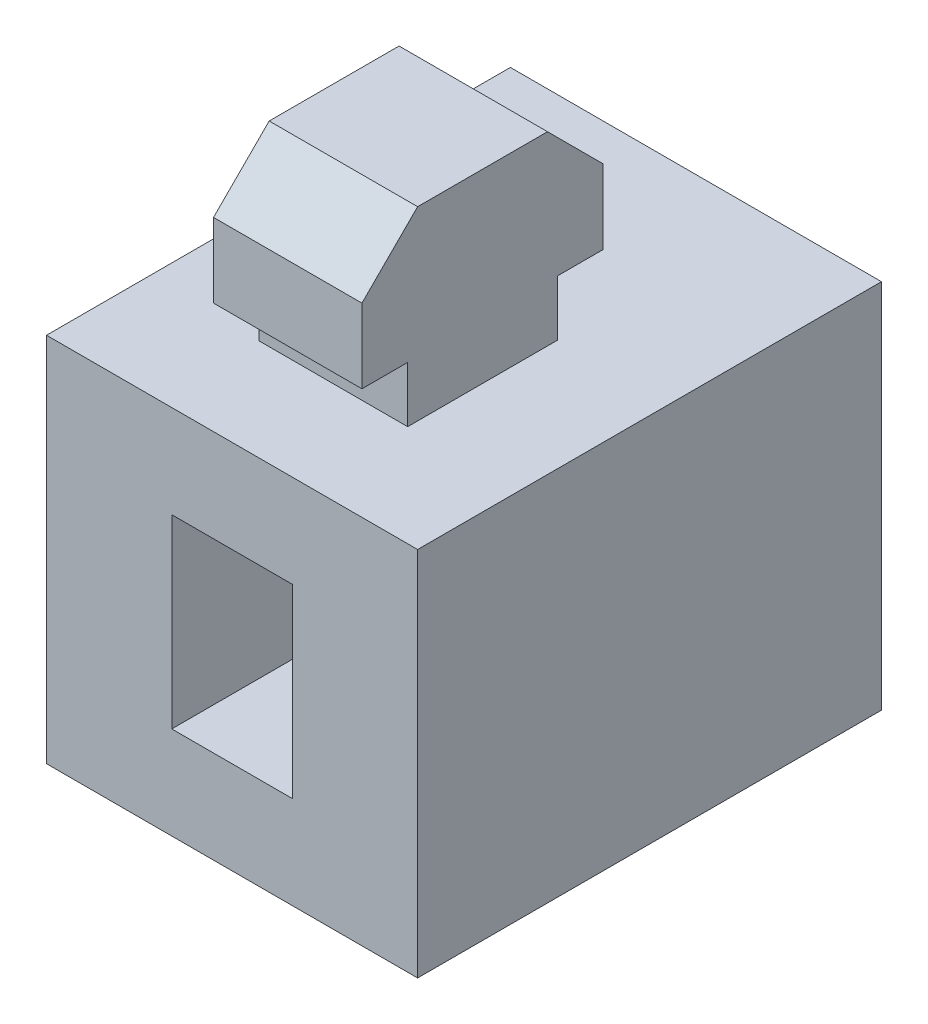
ISO-10303-21;
HEADER;
FILE_DESCRIPTION(('STEP AP214'),'2;1');
FILE_NAME('part.step','',(''),(''),'','','');
FILE_SCHEMA(('AUTOMOTIVE_DESIGN { 1 0 10303 214 1 1 1 1 }'));
ENDSEC;
DATA;
#1=APPLICATION_CONTEXT('core data for automotive mechanical design processes');
#2=APPLICATION_PROTOCOL_DEFINITION('international standard','automotive_design',2000,#1);
#3=PRODUCT_CONTEXT('',#1,'mechanical');
#4=PRODUCT('Part','Part','',(#3));
#5=PRODUCT_RELATED_PRODUCT_CATEGORY('part','',(#4));
#6=PRODUCT_DEFINITION_FORMATION('','',#4);
#7=PRODUCT_DEFINITION_CONTEXT('part definition',#1,'design');
#8=PRODUCT_DEFINITION('design','',#6,#7);
#9=PRODUCT_DEFINITION_SHAPE('','',#8);
#10=(LENGTH_UNIT() NAMED_UNIT(*) SI_UNIT(.MILLI.,.METRE.));
#11=(NAMED_UNIT(*) PLANE_ANGLE_UNIT() SI_UNIT($,.RADIAN.));
#12=(NAMED_UNIT(*) SI_UNIT($,.STERADIAN.) SOLID_ANGLE_UNIT());
#13=UNCERTAINTY_MEASURE_WITH_UNIT(LENGTH_MEASURE(1.E-05),#10,'distance_accuracy_value','');
#14=(GEOMETRIC_REPRESENTATION_CONTEXT(3) GLOBAL_UNCERTAINTY_ASSIGNED_CONTEXT((#13)) GLOBAL_UNIT_ASSIGNED_CONTEXT((#10,
#11,#12)) REPRESENTATION_CONTEXT('',''));
#15=CARTESIAN_POINT('',(0.,0.,0.));
#16=DIRECTION('',(0.,0.,1.));
#17=DIRECTION('',(1.,0.,0.));
#18=AXIS2_PLACEMENT_3D('',#15,#16,#17);
#19=CARTESIAN_POINT('',(-4.,20.,-3.5));
#20=DIRECTION('',(1.,0.,0.));
#21=DIRECTION('',(0.,1.,0.));
#22=AXIS2_PLACEMENT_3D('',#19,#20,#21);
#23=PLANE('',#22);
#24=DIRECTION('',(0.,-0.707106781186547,0.707106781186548));
#25=VECTOR('',#24,1.);
#26=CARTESIAN_POINT('',(-4.,25.,1.5));
#27=LINE('',#26,#25);
#28=CARTESIAN_POINT('',(-4.,20.,6.5));
#29=VERTEX_POINT('',#28);
#30=CARTESIAN_POINT('',(-4.,17.,9.5));
#31=VERTEX_POINT('',#30);
#32=EDGE_CURVE('E208',#29,#31,#27,.T.);
#33=ORIENTED_EDGE('',*,*,#32,.F.);
#34=DIRECTION('',(0.,0.,1.));
#35=VECTOR('',#34,1.);
#36=CARTESIAN_POINT('',(-4.,20.,-3.5));
#37=LINE('',#36,#35);
#38=CARTESIAN_POINT('',(-4.,20.,-0.5));
#39=VERTEX_POINT('',#38);
#40=EDGE_CURVE('E397',#39,#29,#37,.T.);
#41=ORIENTED_EDGE('',*,*,#40,.F.);
#42=DIRECTION('',(0.,-0.707106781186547,-0.707106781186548));
#43=VECTOR('',#42,1.);
#44=CARTESIAN_POINT('',(-4.,18.5,-2.));
#45=LINE('',#44,#43);
#46=CARTESIAN_POINT('',(-4.,17.,-3.5));
#47=VERTEX_POINT('',#46);
#48=EDGE_CURVE('E56',#39,#47,#45,.T.);
#49=ORIENTED_EDGE('',*,*,#48,.T.);
#50=DIRECTION('',(0.,-1.,0.));
#51=VECTOR('',#50,1.);
#52=CARTESIAN_POINT('',(-4.,20.,-3.5));
#53=LINE('',#52,#51);
#54=CARTESIAN_POINT('',(-4.,13.,-3.5));
#55=VERTEX_POINT('',#54);
#56=EDGE_CURVE('E231',#47,#55,#53,.T.);
#57=ORIENTED_EDGE('',*,*,#56,.T.);
#58=DIRECTION('',(0.,0.,1.));
#59=VECTOR('',#58,1.);
#60=CARTESIAN_POINT('',(-4.,13.,-3.5));
#61=LINE('',#60,#59);
#62=CARTESIAN_POINT('',(-4.,13.,-1.03588894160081));
#63=VERTEX_POINT('',#62);
#64=EDGE_CURVE('E389',#55,#63,#61,.T.);
#65=ORIENTED_EDGE('',*,*,#64,.T.);
#66=DIRECTION('',(0.,-1.,0.));
#67=VECTOR('',#66,1.);
#68=CARTESIAN_POINT('',(-4.,20.,-1.03588894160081));
#69=LINE('',#68,#67);
#70=CARTESIAN_POINT('',(-4.,10.,-1.03588894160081));
#71=VERTEX_POINT('',#70);
#72=EDGE_CURVE('E393',#63,#71,#69,.T.);
#73=ORIENTED_EDGE('',*,*,#72,.T.);
#74=DIRECTION('',(0.,0.,1.));
#75=VECTOR('',#74,1.);
#76=CARTESIAN_POINT('',(-4.,10.,-3.5));
#77=LINE('',#76,#75);
#78=CARTESIAN_POINT('',(-4.,10.,7.03588894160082));
#79=VERTEX_POINT('',#78);
#80=EDGE_CURVE('E396',#71,#79,#77,.T.);
#81=ORIENTED_EDGE('',*,*,#80,.T.);
#82=DIRECTION('',(0.,-1.,0.));
#83=VECTOR('',#82,1.);
#84=CARTESIAN_POINT('',(-4.,20.,7.03588894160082));
#85=LINE('',#84,#83);
#86=CARTESIAN_POINT('',(-4.,13.,7.03588894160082));
#87=VERTEX_POINT('',#86);
#88=EDGE_CURVE('E373',#87,#79,#85,.T.);
#89=ORIENTED_EDGE('',*,*,#88,.F.);
#90=DIRECTION('',(0.,0.,-1.));
#91=VECTOR('',#90,1.);
#92=CARTESIAN_POINT('',(-4.,13.,-3.5));
#93=LINE('',#92,#91);
#94=CARTESIAN_POINT('',(-4.,13.,9.5));
#95=VERTEX_POINT('',#94);
#96=EDGE_CURVE('E377',#95,#87,#93,.T.);
#97=ORIENTED_EDGE('',*,*,#96,.F.);
#98=DIRECTION('',(0.,-1.,0.));
#99=VECTOR('',#98,1.);
#100=CARTESIAN_POINT('',(-4.,20.,9.5));
#101=LINE('',#100,#99);
#102=EDGE_CURVE('E226',#31,#95,#101,.T.);
#103=ORIENTED_EDGE('',*,*,#102,.F.);
#104=EDGE_LOOP('',(#33,#41,#49,#57,#65,#73,#81,#89,#97,#103));
#105=FACE_BOUND('',#104,.T.);
#106=ADVANCED_FACE('F34',(#105),#23,.F.);
#107=CARTESIAN_POINT('',(-4.,20.,9.5));
#108=DIRECTION('',(0.,0.,-1.));
#109=DIRECTION('',(-1.,0.,0.));
#110=AXIS2_PLACEMENT_3D('',#107,#108,#109);
#111=PLANE('',#110);
#112=DIRECTION('',(1.,0.,0.));
#113=VECTOR('',#112,1.);
#114=CARTESIAN_POINT('',(-10.,17.,9.5));
#115=LINE('',#114,#113);
#116=CARTESIAN_POINT('',(4.,17.,9.5));
#117=VERTEX_POINT('',#116);
#118=EDGE_CURVE('E205',#31,#117,#115,.T.);
#119=ORIENTED_EDGE('',*,*,#118,.F.);
#120=ORIENTED_EDGE('',*,*,#102,.T.);
#121=DIRECTION('',(-1.,0.,0.));
#122=VECTOR('',#121,1.);
#123=CARTESIAN_POINT('',(-4.,13.,9.5));
#124=LINE('',#123,#122);
#125=CARTESIAN_POINT('',(4.,13.,9.5));
#126=VERTEX_POINT('',#125);
#127=EDGE_CURVE('E225',#126,#95,#124,.T.);
#128=ORIENTED_EDGE('',*,*,#127,.F.);
#129=DIRECTION('',(0.,-1.,0.));
#130=VECTOR('',#129,1.);
#131=CARTESIAN_POINT('',(4.00000000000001,20.,9.5));
#132=LINE('',#131,#130);
#133=EDGE_CURVE('E217',#117,#126,#132,.T.);
#134=ORIENTED_EDGE('',*,*,#133,.F.);
#135=EDGE_LOOP('',(#119,#120,#128,#134));
#136=FACE_BOUND('',#135,.T.);
#137=ADVANCED_FACE('F223',(#136),#111,.F.);
#138=CARTESIAN_POINT('',(4.,20.,-3.5));
#139=DIRECTION('',(-1.,0.,0.));
#140=DIRECTION('',(0.,-1.,0.));
#141=AXIS2_PLACEMENT_3D('',#138,#139,#140);
#142=PLANE('',#141);
#143=DIRECTION('',(0.,-0.707106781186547,0.707106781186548));
#144=VECTOR('',#143,1.);
#145=CARTESIAN_POINT('',(4.,20.,6.5));
#146=LINE('',#145,#144);
#147=CARTESIAN_POINT('',(4.00000000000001,20.,6.5));
#148=VERTEX_POINT('',#147);
#149=EDGE_CURVE('E49',#148,#117,#146,.T.);
#150=ORIENTED_EDGE('',*,*,#149,.T.);
#151=ORIENTED_EDGE('',*,*,#133,.T.);
#152=DIRECTION('',(0.,0.,1.));
#153=VECTOR('',#152,1.);
#154=CARTESIAN_POINT('',(4.,13.,-3.5));
#155=LINE('',#154,#153);
#156=CARTESIAN_POINT('',(4.,13.,7.03588894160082));
#157=VERTEX_POINT('',#156);
#158=EDGE_CURVE('E352',#157,#126,#155,.T.);
#159=ORIENTED_EDGE('',*,*,#158,.F.);
#160=DIRECTION('',(0.,-1.,0.));
#161=VECTOR('',#160,1.);
#162=CARTESIAN_POINT('',(4.,10.,7.03588894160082));
#163=LINE('',#162,#161);
#164=CARTESIAN_POINT('',(4.,10.,7.03588894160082));
#165=VERTEX_POINT('',#164);
#166=EDGE_CURVE('E367',#157,#165,#163,.T.);
#167=ORIENTED_EDGE('',*,*,#166,.T.);
#168=DIRECTION('',(0.,0.,-1.));
#169=VECTOR('',#168,1.);
#170=CARTESIAN_POINT('',(4.,10.,-3.5));
#171=LINE('',#170,#169);
#172=CARTESIAN_POINT('',(4.,10.,-1.03588894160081));
#173=VERTEX_POINT('',#172);
#174=EDGE_CURVE('E399',#165,#173,#171,.T.);
#175=ORIENTED_EDGE('',*,*,#174,.T.);
#176=DIRECTION('',(0.,-1.,0.));
#177=VECTOR('',#176,1.);
#178=CARTESIAN_POINT('',(4.,10.,-1.03588894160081));
#179=LINE('',#178,#177);
#180=CARTESIAN_POINT('',(4.,13.,-1.03588894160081));
#181=VERTEX_POINT('',#180);
#182=EDGE_CURVE('E382',#181,#173,#179,.T.);
#183=ORIENTED_EDGE('',*,*,#182,.F.);
#184=DIRECTION('',(0.,0.,1.));
#185=VECTOR('',#184,1.);
#186=CARTESIAN_POINT('',(4.,13.,-3.53588894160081));
#187=LINE('',#186,#185);
#188=CARTESIAN_POINT('',(4.,13.,-3.5));
#189=VERTEX_POINT('',#188);
#190=EDGE_CURVE('E379',#189,#181,#187,.T.);
#191=ORIENTED_EDGE('',*,*,#190,.F.);
#192=DIRECTION('',(0.,-1.,0.));
#193=VECTOR('',#192,1.);
#194=CARTESIAN_POINT('',(4.,20.,-3.5));
#195=LINE('',#194,#193);
#196=CARTESIAN_POINT('',(4.,17.,-3.5));
#197=VERTEX_POINT('',#196);
#198=EDGE_CURVE('E227',#197,#189,#195,.T.);
#199=ORIENTED_EDGE('',*,*,#198,.F.);
#200=DIRECTION('',(0.,-0.707106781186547,-0.707106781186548));
#201=VECTOR('',#200,1.);
#202=CARTESIAN_POINT('',(4.,20.,-0.499999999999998));
#203=LINE('',#202,#201);
#204=CARTESIAN_POINT('',(4.,20.,-0.499999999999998));
#205=VERTEX_POINT('',#204);
#206=EDGE_CURVE('E354',#205,#197,#203,.T.);
#207=ORIENTED_EDGE('',*,*,#206,.F.);
#208=DIRECTION('',(0.,0.,-1.));
#209=VECTOR('',#208,1.);
#210=CARTESIAN_POINT('',(4.,20.,-3.5));
#211=LINE('',#210,#209);
#212=EDGE_CURVE('E220',#148,#205,#211,.T.);
#213=ORIENTED_EDGE('',*,*,#212,.F.);
#214=EDGE_LOOP('',(#150,#151,#159,#167,#175,#183,#191,#199,#207,#213));
#215=FACE_BOUND('',#214,.T.);
#216=ADVANCED_FACE('F215',(#215),#142,.F.);
#217=CARTESIAN_POINT('',(0.,20.,0.));
#218=DIRECTION('',(0.,1.,0.));
#219=DIRECTION('',(0.,0.,1.));
#220=AXIS2_PLACEMENT_3D('',#217,#218,#219);
#221=PLANE('',#220);
#222=ORIENTED_EDGE('',*,*,#40,.T.);
#223=DIRECTION('',(1.,0.,0.));
#224=VECTOR('',#223,1.);
#225=CARTESIAN_POINT('',(0.,20.,6.5));
#226=LINE('',#225,#224);
#227=EDGE_CURVE('E11',#29,#148,#226,.T.);
#228=ORIENTED_EDGE('',*,*,#227,.T.);
#229=ORIENTED_EDGE('',*,*,#212,.T.);
#230=DIRECTION('',(1.,0.,0.));
#231=VECTOR('',#230,1.);
#232=CARTESIAN_POINT('',(0.,20.,-0.499999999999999));
#233=LINE('',#232,#231);
#234=EDGE_CURVE('E42',#39,#205,#233,.T.);
#235=ORIENTED_EDGE('',*,*,#234,.F.);
#236=EDGE_LOOP('',(#222,#228,#229,#235));
#237=FACE_BOUND('',#236,.T.);
#238=ADVANCED_FACE('F481',(#237),#221,.T.);
#239=CARTESIAN_POINT('',(-10.,10.,12.5));
#240=DIRECTION('',(0.,-1.,0.));
#241=DIRECTION('',(1.,0.,0.));
#242=AXIS2_PLACEMENT_3D('',#239,#240,#241);
#243=PLANE('',#242);
#244=DIRECTION('',(-1.,0.,0.));
#245=VECTOR('',#244,1.);
#246=CARTESIAN_POINT('',(-10.,10.,-12.5));
#247=LINE('',#246,#245);
#248=CARTESIAN_POINT('',(10.,10.,-12.5));
#249=VERTEX_POINT('',#248);
#250=CARTESIAN_POINT('',(-10.,10.,-12.5));
#251=VERTEX_POINT('',#250);
#252=EDGE_CURVE('E320',#249,#251,#247,.T.);
#253=ORIENTED_EDGE('',*,*,#252,.T.);
#254=DIRECTION('',(0.,0.,-1.));
#255=VECTOR('',#254,1.);
#256=CARTESIAN_POINT('',(-10.,10.,12.5));
#257=LINE('',#256,#255);
#258=CARTESIAN_POINT('',(-10.,10.,12.5));
#259=VERTEX_POINT('',#258);
#260=EDGE_CURVE('E326',#259,#251,#257,.T.);
#261=ORIENTED_EDGE('',*,*,#260,.F.);
#262=DIRECTION('',(-1.,0.,0.));
#263=VECTOR('',#262,1.);
#264=CARTESIAN_POINT('',(-10.,10.,12.5));
#265=LINE('',#264,#263);
#266=CARTESIAN_POINT('',(10.,10.,12.5));
#267=VERTEX_POINT('',#266);
#268=EDGE_CURVE('E324',#267,#259,#265,.T.);
#269=ORIENTED_EDGE('',*,*,#268,.F.);
#270=DIRECTION('',(0.,0.,-1.));
#271=VECTOR('',#270,1.);
#272=CARTESIAN_POINT('',(10.,10.,12.5));
#273=LINE('',#272,#271);
#274=EDGE_CURVE('E336',#267,#249,#273,.T.);
#275=ORIENTED_EDGE('',*,*,#274,.T.);
#276=EDGE_LOOP('',(#253,#261,#269,#275));
#277=FACE_BOUND('',#276,.T.);
#278=DIRECTION('',(1.,0.,0.));
#279=VECTOR('',#278,1.);
#280=CARTESIAN_POINT('',(-10.,10.,7.03588894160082));
#281=LINE('',#280,#279);
#282=EDGE_CURVE('E370',#79,#165,#281,.T.);
#283=ORIENTED_EDGE('',*,*,#282,.F.);
#284=ORIENTED_EDGE('',*,*,#80,.F.);
#285=DIRECTION('',(1.,0.,0.));
#286=VECTOR('',#285,1.);
#287=CARTESIAN_POINT('',(-10.,10.,-1.03588894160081));
#288=LINE('',#287,#286);
#289=EDGE_CURVE('E386',#71,#173,#288,.T.);
#290=ORIENTED_EDGE('',*,*,#289,.T.);
#291=ORIENTED_EDGE('',*,*,#174,.F.);
#292=EDGE_LOOP('',(#283,#284,#290,#291));
#293=FACE_BOUND('',#292,.T.);
#294=ADVANCED_FACE('F478',(#277,#293),#243,.F.);
#295=CARTESIAN_POINT('',(-3.25,5.,12.5));
#296=DIRECTION('',(1.,0.,0.));
#297=DIRECTION('',(0.,1.,0.));
#298=AXIS2_PLACEMENT_3D('',#295,#296,#297);
#299=PLANE('',#298);
#300=DIRECTION('',(0.,-1.,0.));
#301=VECTOR('',#300,1.);
#302=CARTESIAN_POINT('',(-3.25,5.,5.5));
#303=LINE('',#302,#301);
#304=CARTESIAN_POINT('',(-3.25,5.,5.5));
#305=VERTEX_POINT('',#304);
#306=CARTESIAN_POINT('',(-3.25,-5.,5.5));
#307=VERTEX_POINT('',#306);
#308=EDGE_CURVE('E276',#305,#307,#303,.T.);
#309=ORIENTED_EDGE('',*,*,#308,.F.);
#310=DIRECTION('',(0.,0.,-1.));
#311=VECTOR('',#310,1.);
#312=CARTESIAN_POINT('',(-3.25,5.,12.5));
#313=LINE('',#312,#311);
#314=CARTESIAN_POINT('',(-3.25,5.,12.5));
#315=VERTEX_POINT('',#314);
#316=EDGE_CURVE('E300',#315,#305,#313,.T.);
#317=ORIENTED_EDGE('',*,*,#316,.F.);
#318=DIRECTION('',(0.,-1.,0.));
#319=VECTOR('',#318,1.);
#320=CARTESIAN_POINT('',(-3.25,5.,12.5));
#321=LINE('',#320,#319);
#322=CARTESIAN_POINT('',(-3.25,-5.,12.5));
#323=VERTEX_POINT('',#322);
#324=EDGE_CURVE('E279',#315,#323,#321,.T.);
#325=ORIENTED_EDGE('',*,*,#324,.T.);
#326=DIRECTION('',(0.,0.,-1.));
#327=VECTOR('',#326,1.);
#328=CARTESIAN_POINT('',(-3.25,-5.,12.5));
#329=LINE('',#328,#327);
#330=EDGE_CURVE('E312',#323,#307,#329,.T.);
#331=ORIENTED_EDGE('',*,*,#330,.T.);
#332=EDGE_LOOP('',(#309,#317,#325,#331));
#333=FACE_BOUND('',#332,.T.);
#334=ADVANCED_FACE('F469',(#333),#299,.T.);
#335=CARTESIAN_POINT('',(-3.25,-5.,12.5));
#336=DIRECTION('',(0.,1.,0.));
#337=DIRECTION('',(-1.,0.,0.));
#338=AXIS2_PLACEMENT_3D('',#335,#336,#337);
#339=PLANE('',#338);
#340=DIRECTION('',(1.,0.,0.));
#341=VECTOR('',#340,1.);
#342=CARTESIAN_POINT('',(-3.25,-5.,5.5));
#343=LINE('',#342,#341);
#344=CARTESIAN_POINT('',(3.25,-5.,5.5));
#345=VERTEX_POINT('',#344);
#346=EDGE_CURVE('E274',#307,#345,#343,.T.);
#347=ORIENTED_EDGE('',*,*,#346,.F.);
#348=ORIENTED_EDGE('',*,*,#330,.F.);
#349=DIRECTION('',(1.,0.,0.));
#350=VECTOR('',#349,1.);
#351=CARTESIAN_POINT('',(-3.25,-5.,12.5));
#352=LINE('',#351,#350);
#353=CARTESIAN_POINT('',(3.25,-5.,12.5));
#354=VERTEX_POINT('',#353);
#355=EDGE_CURVE('E281',#323,#354,#352,.T.);
#356=ORIENTED_EDGE('',*,*,#355,.T.);
#357=DIRECTION('',(0.,0.,-1.));
#358=VECTOR('',#357,1.);
#359=CARTESIAN_POINT('',(3.25,-5.,12.5));
#360=LINE('',#359,#358);
#361=EDGE_CURVE('E308',#354,#345,#360,.T.);
#362=ORIENTED_EDGE('',*,*,#361,.T.);
#363=EDGE_LOOP('',(#347,#348,#356,#362));
#364=FACE_BOUND('',#363,.T.);
#365=ADVANCED_FACE('F464',(#364),#339,.T.);
#366=CARTESIAN_POINT('',(3.25,5.,12.5));
#367=DIRECTION('',(-1.,0.,0.));
#368=DIRECTION('',(0.,-1.,0.));
#369=AXIS2_PLACEMENT_3D('',#366,#367,#368);
#370=PLANE('',#369);
#371=DIRECTION('',(0.,1.,0.));
#372=VECTOR('',#371,1.);
#373=CARTESIAN_POINT('',(3.25,5.,5.5));
#374=LINE('',#373,#372);
#375=CARTESIAN_POINT('',(3.25,5.,5.5));
#376=VERTEX_POINT('',#375);
#377=EDGE_CURVE('E272',#345,#376,#374,.T.);
#378=ORIENTED_EDGE('',*,*,#377,.F.);
#379=ORIENTED_EDGE('',*,*,#361,.F.);
#380=DIRECTION('',(0.,1.,0.));
#381=VECTOR('',#380,1.);
#382=CARTESIAN_POINT('',(3.25,5.,12.5));
#383=LINE('',#382,#381);
#384=CARTESIAN_POINT('',(3.25,5.,12.5));
#385=VERTEX_POINT('',#384);
#386=EDGE_CURVE('E284',#354,#385,#383,.T.);
#387=ORIENTED_EDGE('',*,*,#386,.T.);
#388=DIRECTION('',(0.,0.,-1.));
#389=VECTOR('',#388,1.);
#390=CARTESIAN_POINT('',(3.25,5.,12.5));
#391=LINE('',#390,#389);
#392=EDGE_CURVE('E304',#385,#376,#391,.T.);
#393=ORIENTED_EDGE('',*,*,#392,.T.);
#394=EDGE_LOOP('',(#378,#379,#387,#393));
#395=FACE_BOUND('',#394,.T.);
#396=ADVANCED_FACE('F459',(#395),#370,.T.);
#397=CARTESIAN_POINT('',(-3.25,5.,12.5));
#398=DIRECTION('',(0.,-1.,0.));
#399=DIRECTION('',(1.,0.,0.));
#400=AXIS2_PLACEMENT_3D('',#397,#398,#399);
#401=PLANE('',#400);
#402=DIRECTION('',(-1.,0.,0.));
#403=VECTOR('',#402,1.);
#404=CARTESIAN_POINT('',(-3.25,5.,5.5));
#405=LINE('',#404,#403);
#406=EDGE_CURVE('E347',#376,#305,#405,.T.);
#407=ORIENTED_EDGE('',*,*,#406,.F.);
#408=ORIENTED_EDGE('',*,*,#392,.F.);
#409=DIRECTION('',(-1.,0.,0.));
#410=VECTOR('',#409,1.);
#411=CARTESIAN_POINT('',(-3.25,5.,12.5));
#412=LINE('',#411,#410);
#413=EDGE_CURVE('E287',#385,#315,#412,.T.);
#414=ORIENTED_EDGE('',*,*,#413,.T.);
#415=ORIENTED_EDGE('',*,*,#316,.T.);
#416=EDGE_LOOP('',(#407,#408,#414,#415));
#417=FACE_BOUND('',#416,.T.);
#418=ADVANCED_FACE('F454',(#417),#401,.T.);
#419=CARTESIAN_POINT('',(0.,0.,12.5));
#420=DIRECTION('',(0.,0.,1.));
#421=DIRECTION('',(1.,0.,0.));
#422=AXIS2_PLACEMENT_3D('',#419,#420,#421);
#423=PLANE('',#422);
#424=DIRECTION('',(0.,-1.,0.));
#425=VECTOR('',#424,1.);
#426=CARTESIAN_POINT('',(-10.,10.,12.5));
#427=LINE('',#426,#425);
#428=CARTESIAN_POINT('',(-10.,-10.,12.5));
#429=VERTEX_POINT('',#428);
#430=EDGE_CURVE('E316',#259,#429,#427,.T.);
#431=ORIENTED_EDGE('',*,*,#430,.T.);
#432=DIRECTION('',(1.,0.,0.));
#433=VECTOR('',#432,1.);
#434=CARTESIAN_POINT('',(-10.,-10.,12.5));
#435=LINE('',#434,#433);
#436=CARTESIAN_POINT('',(10.,-10.,12.5));
#437=VERTEX_POINT('',#436);
#438=EDGE_CURVE('E319',#429,#437,#435,.T.);
#439=ORIENTED_EDGE('',*,*,#438,.T.);
#440=DIRECTION('',(0.,1.,0.));
#441=VECTOR('',#440,1.);
#442=CARTESIAN_POINT('',(10.,10.,12.5));
#443=LINE('',#442,#441);
#444=EDGE_CURVE('E322',#437,#267,#443,.T.);
#445=ORIENTED_EDGE('',*,*,#444,.T.);
#446=ORIENTED_EDGE('',*,*,#268,.T.);
#447=EDGE_LOOP('',(#431,#439,#445,#446));
#448=FACE_BOUND('',#447,.T.);
#449=ORIENTED_EDGE('',*,*,#355,.F.);
#450=ORIENTED_EDGE('',*,*,#324,.F.);
#451=ORIENTED_EDGE('',*,*,#413,.F.);
#452=ORIENTED_EDGE('',*,*,#386,.F.);
#453=EDGE_LOOP('',(#449,#450,#451,#452));
#454=FACE_BOUND('',#453,.T.);
#455=ADVANCED_FACE('F470',(#448,#454),#423,.T.);
#456=CARTESIAN_POINT('',(0.,0.,-12.5));
#457=DIRECTION('',(0.,0.,1.));
#458=DIRECTION('',(1.,0.,0.));
#459=AXIS2_PLACEMENT_3D('',#456,#457,#458);
#460=PLANE('',#459);
#461=DIRECTION('',(0.,-1.,0.));
#462=VECTOR('',#461,1.);
#463=CARTESIAN_POINT('',(-10.,10.,-12.5));
#464=LINE('',#463,#462);
#465=CARTESIAN_POINT('',(-10.,-10.,-12.5));
#466=VERTEX_POINT('',#465);
#467=EDGE_CURVE('E315',#251,#466,#464,.T.);
#468=ORIENTED_EDGE('',*,*,#467,.F.);
#469=ORIENTED_EDGE('',*,*,#252,.F.);
#470=DIRECTION('',(0.,1.,0.));
#471=VECTOR('',#470,1.);
#472=CARTESIAN_POINT('',(10.,10.,-12.5));
#473=LINE('',#472,#471);
#474=CARTESIAN_POINT('',(10.,-10.,-12.5));
#475=VERTEX_POINT('',#474);
#476=EDGE_CURVE('E331',#475,#249,#473,.T.);
#477=ORIENTED_EDGE('',*,*,#476,.F.);
#478=DIRECTION('',(1.,0.,0.));
#479=VECTOR('',#478,1.);
#480=CARTESIAN_POINT('',(-10.,-10.,-12.5));
#481=LINE('',#480,#479);
#482=EDGE_CURVE('E329',#466,#475,#481,.T.);
#483=ORIENTED_EDGE('',*,*,#482,.F.);
#484=EDGE_LOOP('',(#468,#469,#477,#483));
#485=FACE_BOUND('',#484,.T.);
#486=DIRECTION('',(0.,-1.,0.));
#487=VECTOR('',#486,1.);
#488=CARTESIAN_POINT('',(-3.25,5.,-12.5));
#489=LINE('',#488,#487);
#490=CARTESIAN_POINT('',(-3.25,5.,-12.5));
#491=VERTEX_POINT('',#490);
#492=CARTESIAN_POINT('',(-3.25,-5.,-12.5));
#493=VERTEX_POINT('',#492);
#494=EDGE_CURVE('E278',#491,#493,#489,.T.);
#495=ORIENTED_EDGE('',*,*,#494,.T.);
#496=DIRECTION('',(1.,0.,0.));
#497=VECTOR('',#496,1.);
#498=CARTESIAN_POINT('',(-3.25,-5.,-12.5));
#499=LINE('',#498,#497);
#500=CARTESIAN_POINT('',(3.25,-5.,-12.5));
#501=VERTEX_POINT('',#500);
#502=EDGE_CURVE('E292',#493,#501,#499,.T.);
#503=ORIENTED_EDGE('',*,*,#502,.T.);
#504=DIRECTION('',(0.,1.,0.));
#505=VECTOR('',#504,1.);
#506=CARTESIAN_POINT('',(3.25,5.,-12.5));
#507=LINE('',#506,#505);
#508=CARTESIAN_POINT('',(3.25,5.,-12.5));
#509=VERTEX_POINT('',#508);
#510=EDGE_CURVE('E295',#501,#509,#507,.T.);
#511=ORIENTED_EDGE('',*,*,#510,.T.);
#512=DIRECTION('',(-1.,0.,0.));
#513=VECTOR('',#512,1.);
#514=CARTESIAN_POINT('',(-3.25,5.,-12.5));
#515=LINE('',#514,#513);
#516=EDGE_CURVE('E282',#509,#491,#515,.T.);
#517=ORIENTED_EDGE('',*,*,#516,.T.);
#518=EDGE_LOOP('',(#495,#503,#511,#517));
#519=FACE_BOUND('',#518,.T.);
#520=ADVANCED_FACE('F473',(#485,#519),#460,.F.);
#521=CARTESIAN_POINT('',(-10.,10.,12.5));
#522=DIRECTION('',(1.,0.,0.));
#523=DIRECTION('',(0.,1.,0.));
#524=AXIS2_PLACEMENT_3D('',#521,#522,#523);
#525=PLANE('',#524);
#526=ORIENTED_EDGE('',*,*,#467,.T.);
#527=DIRECTION('',(0.,0.,-1.));
#528=VECTOR('',#527,1.);
#529=CARTESIAN_POINT('',(-10.,-10.,12.5));
#530=LINE('',#529,#528);
#531=EDGE_CURVE('E342',#429,#466,#530,.T.);
#532=ORIENTED_EDGE('',*,*,#531,.F.);
#533=ORIENTED_EDGE('',*,*,#430,.F.);
#534=ORIENTED_EDGE('',*,*,#260,.T.);
#535=EDGE_LOOP('',(#526,#532,#533,#534));
#536=FACE_BOUND('',#535,.T.);
#537=ADVANCED_FACE('F36',(#536),#525,.F.);
#538=CARTESIAN_POINT('',(-10.,-10.,12.5));
#539=DIRECTION('',(0.,1.,0.));
#540=DIRECTION('',(0.,0.,1.));
#541=AXIS2_PLACEMENT_3D('',#538,#539,#540);
#542=PLANE('',#541);
#543=DIRECTION('',(1.,0.,0.));
#544=VECTOR('',#543,1.);
#545=CARTESIAN_POINT('',(-5.,-10.,0.5));
#546=LINE('',#545,#544);
#547=CARTESIAN_POINT('',(-5.,-10.,0.5));
#548=VERTEX_POINT('',#547);
#549=CARTESIAN_POINT('',(5.,-10.,0.5));
#550=VERTEX_POINT('',#549);
#551=EDGE_CURVE('E250',#548,#550,#546,.T.);
#552=ORIENTED_EDGE('',*,*,#551,.F.);
#553=DIRECTION('',(0.,0.,-1.));
#554=VECTOR('',#553,1.);
#555=CARTESIAN_POINT('',(-5.,-10.,5.5));
#556=LINE('',#555,#554);
#557=CARTESIAN_POINT('',(-5.,-10.,5.5));
#558=VERTEX_POINT('',#557);
#559=EDGE_CURVE('E229',#558,#548,#556,.T.);
#560=ORIENTED_EDGE('',*,*,#559,.F.);
#561=DIRECTION('',(-1.,0.,0.));
#562=VECTOR('',#561,1.);
#563=CARTESIAN_POINT('',(-5.,-10.,5.5));
#564=LINE('',#563,#562);
#565=CARTESIAN_POINT('',(5.,-10.,5.5));
#566=VERTEX_POINT('',#565);
#567=EDGE_CURVE('E239',#566,#558,#564,.T.);
#568=ORIENTED_EDGE('',*,*,#567,.F.);
#569=DIRECTION('',(0.,0.,1.));
#570=VECTOR('',#569,1.);
#571=CARTESIAN_POINT('',(5.,-10.,5.5));
#572=LINE('',#571,#570);
#573=EDGE_CURVE('E253',#550,#566,#572,.T.);
#574=ORIENTED_EDGE('',*,*,#573,.F.);
#575=EDGE_LOOP('',(#552,#560,#568,#574));
#576=FACE_BOUND('',#575,.T.);
#577=ORIENTED_EDGE('',*,*,#482,.T.);
#578=DIRECTION('',(0.,0.,-1.));
#579=VECTOR('',#578,1.);
#580=CARTESIAN_POINT('',(10.,-10.,12.5));
#581=LINE('',#580,#579);
#582=EDGE_CURVE('E339',#437,#475,#581,.T.);
#583=ORIENTED_EDGE('',*,*,#582,.F.);
#584=ORIENTED_EDGE('',*,*,#438,.F.);
#585=ORIENTED_EDGE('',*,*,#531,.T.);
#586=EDGE_LOOP('',(#577,#583,#584,#585));
#587=FACE_BOUND('',#586,.T.);
#588=ADVANCED_FACE('F484',(#576,#587),#542,.F.);
#589=CARTESIAN_POINT('',(10.,10.,12.5));
#590=DIRECTION('',(-1.,0.,0.));
#591=DIRECTION('',(0.,0.,1.));
#592=AXIS2_PLACEMENT_3D('',#589,#590,#591);
#593=PLANE('',#592);
#594=ORIENTED_EDGE('',*,*,#476,.T.);
#595=ORIENTED_EDGE('',*,*,#274,.F.);
#596=ORIENTED_EDGE('',*,*,#444,.F.);
#597=ORIENTED_EDGE('',*,*,#582,.T.);
#598=EDGE_LOOP('',(#594,#595,#596,#597));
#599=FACE_BOUND('',#598,.T.);
#600=ADVANCED_FACE('F467',(#599),#593,.F.);
#601=DIRECTION('',(0.,1.,0.));
#602=VECTOR('',#601,1.);
#603=CARTESIAN_POINT('',(-3.25,5.,0.5));
#604=LINE('',#603,#602);
#605=CARTESIAN_POINT('',(-3.25,-5.,0.5));
#606=VERTEX_POINT('',#605);
#607=CARTESIAN_POINT('',(-3.25,5.,0.5));
#608=VERTEX_POINT('',#607);
#609=EDGE_CURVE('E270',#606,#608,#604,.T.);
#610=ORIENTED_EDGE('',*,*,#609,.F.);
#611=EDGE_CURVE('E311',#606,#493,#329,.T.);
#612=ORIENTED_EDGE('',*,*,#611,.T.);
#613=ORIENTED_EDGE('',*,*,#494,.F.);
#614=EDGE_CURVE('E289',#608,#491,#313,.T.);
#615=ORIENTED_EDGE('',*,*,#614,.F.);
#616=EDGE_LOOP('',(#610,#612,#613,#615));
#617=FACE_BOUND('',#616,.T.);
#618=ADVANCED_FACE('F462',(#617),#299,.T.);
#619=DIRECTION('',(-1.,0.,0.));
#620=VECTOR('',#619,1.);
#621=CARTESIAN_POINT('',(-3.25,-5.,0.5));
#622=LINE('',#621,#620);
#623=CARTESIAN_POINT('',(3.25,-5.,0.5));
#624=VERTEX_POINT('',#623);
#625=EDGE_CURVE('E268',#624,#606,#622,.T.);
#626=ORIENTED_EDGE('',*,*,#625,.F.);
#627=EDGE_CURVE('E307',#624,#501,#360,.T.);
#628=ORIENTED_EDGE('',*,*,#627,.T.);
#629=ORIENTED_EDGE('',*,*,#502,.F.);
#630=ORIENTED_EDGE('',*,*,#611,.F.);
#631=EDGE_LOOP('',(#626,#628,#629,#630));
#632=FACE_BOUND('',#631,.T.);
#633=ADVANCED_FACE('F457',(#632),#339,.T.);
#634=DIRECTION('',(0.,-1.,0.));
#635=VECTOR('',#634,1.);
#636=CARTESIAN_POINT('',(3.25,5.,0.5));
#637=LINE('',#636,#635);
#638=CARTESIAN_POINT('',(3.25,5.,0.5));
#639=VERTEX_POINT('',#638);
#640=EDGE_CURVE('E260',#639,#624,#637,.T.);
#641=ORIENTED_EDGE('',*,*,#640,.F.);
#642=EDGE_CURVE('E303',#639,#509,#391,.T.);
#643=ORIENTED_EDGE('',*,*,#642,.T.);
#644=ORIENTED_EDGE('',*,*,#510,.F.);
#645=ORIENTED_EDGE('',*,*,#627,.F.);
#646=EDGE_LOOP('',(#641,#643,#644,#645));
#647=FACE_BOUND('',#646,.T.);
#648=ADVANCED_FACE('F452',(#647),#370,.T.);
#649=DIRECTION('',(1.,0.,0.));
#650=VECTOR('',#649,1.);
#651=CARTESIAN_POINT('',(-3.25,5.,0.5));
#652=LINE('',#651,#650);
#653=EDGE_CURVE('E345',#608,#639,#652,.T.);
#654=ORIENTED_EDGE('',*,*,#653,.F.);
#655=ORIENTED_EDGE('',*,*,#614,.T.);
#656=ORIENTED_EDGE('',*,*,#516,.F.);
#657=ORIENTED_EDGE('',*,*,#642,.F.);
#658=EDGE_LOOP('',(#654,#655,#656,#657));
#659=FACE_BOUND('',#658,.T.);
#660=ADVANCED_FACE('F448',(#659),#401,.T.);
#661=CARTESIAN_POINT('',(-5.,7.,5.5));
#662=DIRECTION('',(-1.,0.,0.));
#663=DIRECTION('',(0.,0.,1.));
#664=AXIS2_PLACEMENT_3D('',#661,#662,#663);
#665=PLANE('',#664);
#666=ORIENTED_EDGE('',*,*,#559,.T.);
#667=DIRECTION('',(0.,-1.,0.));
#668=VECTOR('',#667,1.);
#669=CARTESIAN_POINT('',(-5.,7.,0.5));
#670=LINE('',#669,#668);
#671=CARTESIAN_POINT('',(-5.,7.,0.5));
#672=VERTEX_POINT('',#671);
#673=EDGE_CURVE('E248',#672,#548,#670,.T.);
#674=ORIENTED_EDGE('',*,*,#673,.F.);
#675=DIRECTION('',(0.,0.,-1.));
#676=VECTOR('',#675,1.);
#677=CARTESIAN_POINT('',(-5.,7.,5.5));
#678=LINE('',#677,#676);
#679=CARTESIAN_POINT('',(-5.,7.,5.5));
#680=VERTEX_POINT('',#679);
#681=EDGE_CURVE('E235',#680,#672,#678,.T.);
#682=ORIENTED_EDGE('',*,*,#681,.F.);
#683=DIRECTION('',(0.,-1.,0.));
#684=VECTOR('',#683,1.);
#685=CARTESIAN_POINT('',(-5.,7.,5.5));
#686=LINE('',#685,#684);
#687=EDGE_CURVE('E258',#680,#558,#686,.T.);
#688=ORIENTED_EDGE('',*,*,#687,.T.);
#689=EDGE_LOOP('',(#666,#674,#682,#688));
#690=FACE_BOUND('',#689,.T.);
#691=ADVANCED_FACE('F438',(#690),#665,.F.);
#692=CARTESIAN_POINT('',(-5.,7.,5.5));
#693=DIRECTION('',(0.,0.,1.));
#694=DIRECTION('',(1.,0.,0.));
#695=AXIS2_PLACEMENT_3D('',#692,#693,#694);
#696=PLANE('',#695);
#697=ORIENTED_EDGE('',*,*,#308,.T.);
#698=ORIENTED_EDGE('',*,*,#346,.T.);
#699=ORIENTED_EDGE('',*,*,#377,.T.);
#700=ORIENTED_EDGE('',*,*,#406,.T.);
#701=EDGE_LOOP('',(#697,#698,#699,#700));
#702=FACE_BOUND('',#701,.T.);
#703=ORIENTED_EDGE('',*,*,#567,.T.);
#704=ORIENTED_EDGE('',*,*,#687,.F.);
#705=DIRECTION('',(-1.,0.,0.));
#706=VECTOR('',#705,1.);
#707=CARTESIAN_POINT('',(-5.,7.,5.5));
#708=LINE('',#707,#706);
#709=CARTESIAN_POINT('',(5.,7.,5.5));
#710=VERTEX_POINT('',#709);
#711=EDGE_CURVE('E245',#710,#680,#708,.T.);
#712=ORIENTED_EDGE('',*,*,#711,.F.);
#713=DIRECTION('',(0.,-1.,0.));
#714=VECTOR('',#713,1.);
#715=CARTESIAN_POINT('',(5.,7.,5.5));
#716=LINE('',#715,#714);
#717=EDGE_CURVE('E261',#710,#566,#716,.T.);
#718=ORIENTED_EDGE('',*,*,#717,.T.);
#719=EDGE_LOOP('',(#703,#704,#712,#718));
#720=FACE_BOUND('',#719,.T.);
#721=ADVANCED_FACE('F434',(#702,#720),#696,.F.);
#722=CARTESIAN_POINT('',(5.,7.,5.5));
#723=DIRECTION('',(1.,0.,0.));
#724=DIRECTION('',(0.,0.,-1.));
#725=AXIS2_PLACEMENT_3D('',#722,#723,#724);
#726=PLANE('',#725);
#727=ORIENTED_EDGE('',*,*,#573,.T.);
#728=ORIENTED_EDGE('',*,*,#717,.F.);
#729=DIRECTION('',(0.,0.,1.));
#730=VECTOR('',#729,1.);
#731=CARTESIAN_POINT('',(5.,7.,5.5));
#732=LINE('',#731,#730);
#733=CARTESIAN_POINT('',(5.,7.,0.5));
#734=VERTEX_POINT('',#733);
#735=EDGE_CURVE('E242',#734,#710,#732,.T.);
#736=ORIENTED_EDGE('',*,*,#735,.F.);
#737=DIRECTION('',(0.,-1.,0.));
#738=VECTOR('',#737,1.);
#739=CARTESIAN_POINT('',(5.,7.,0.5));
#740=LINE('',#739,#738);
#741=EDGE_CURVE('E263',#734,#550,#740,.T.);
#742=ORIENTED_EDGE('',*,*,#741,.T.);
#743=EDGE_LOOP('',(#727,#728,#736,#742));
#744=FACE_BOUND('',#743,.T.);
#745=ADVANCED_FACE('F437',(#744),#726,.F.);
#746=CARTESIAN_POINT('',(-5.,7.,0.5));
#747=DIRECTION('',(0.,0.,-1.));
#748=DIRECTION('',(-1.,0.,0.));
#749=AXIS2_PLACEMENT_3D('',#746,#747,#748);
#750=PLANE('',#749);
#751=ORIENTED_EDGE('',*,*,#609,.T.);
#752=ORIENTED_EDGE('',*,*,#653,.T.);
#753=ORIENTED_EDGE('',*,*,#640,.T.);
#754=ORIENTED_EDGE('',*,*,#625,.T.);
#755=EDGE_LOOP('',(#751,#752,#753,#754));
#756=FACE_BOUND('',#755,.T.);
#757=ORIENTED_EDGE('',*,*,#551,.T.);
#758=ORIENTED_EDGE('',*,*,#741,.F.);
#759=DIRECTION('',(1.,0.,0.));
#760=VECTOR('',#759,1.);
#761=CARTESIAN_POINT('',(-5.,7.,0.5));
#762=LINE('',#761,#760);
#763=EDGE_CURVE('E238',#672,#734,#762,.T.);
#764=ORIENTED_EDGE('',*,*,#763,.F.);
#765=ORIENTED_EDGE('',*,*,#673,.T.);
#766=EDGE_LOOP('',(#757,#758,#764,#765));
#767=FACE_BOUND('',#766,.T.);
#768=ADVANCED_FACE('F422',(#756,#767),#750,.F.);
#769=CARTESIAN_POINT('',(0.,7.,0.));
#770=DIRECTION('',(0.,-1.,0.));
#771=DIRECTION('',(0.,0.,-1.));
#772=AXIS2_PLACEMENT_3D('',#769,#770,#771);
#773=PLANE('',#772);
#774=ORIENTED_EDGE('',*,*,#681,.T.);
#775=ORIENTED_EDGE('',*,*,#763,.T.);
#776=ORIENTED_EDGE('',*,*,#735,.T.);
#777=ORIENTED_EDGE('',*,*,#711,.T.);
#778=EDGE_LOOP('',(#774,#775,#776,#777));
#779=FACE_BOUND('',#778,.T.);
#780=ADVANCED_FACE('F414',(#779),#773,.T.);
#781=CARTESIAN_POINT('',(-4.,20.,-3.5));
#782=DIRECTION('',(0.,0.,1.));
#783=DIRECTION('',(1.,0.,0.));
#784=AXIS2_PLACEMENT_3D('',#781,#782,#783);
#785=PLANE('',#784);
#786=ORIENTED_EDGE('',*,*,#56,.F.);
#787=DIRECTION('',(1.,0.,0.));
#788=VECTOR('',#787,1.);
#789=CARTESIAN_POINT('',(-10.,17.,-3.5));
#790=LINE('',#789,#788);
#791=EDGE_CURVE('E361',#47,#197,#790,.T.);
#792=ORIENTED_EDGE('',*,*,#791,.T.);
#793=ORIENTED_EDGE('',*,*,#198,.T.);
#794=DIRECTION('',(-1.,0.,0.));
#795=VECTOR('',#794,1.);
#796=CARTESIAN_POINT('',(-4.,13.,-3.5));
#797=LINE('',#796,#795);
#798=EDGE_CURVE('E349',#189,#55,#797,.T.);
#799=ORIENTED_EDGE('',*,*,#798,.T.);
#800=EDGE_LOOP('',(#786,#792,#793,#799));
#801=FACE_BOUND('',#800,.T.);
#802=ADVANCED_FACE('F411',(#801),#785,.F.);
#803=CARTESIAN_POINT('',(-10.,10.,-1.03588894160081));
#804=DIRECTION('',(0.,0.,1.));
#805=DIRECTION('',(1.,0.,0.));
#806=AXIS2_PLACEMENT_3D('',#803,#804,#805);
#807=PLANE('',#806);
#808=DIRECTION('',(1.,0.,0.));
#809=VECTOR('',#808,1.);
#810=CARTESIAN_POINT('',(-10.,13.,-1.03588894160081));
#811=LINE('',#810,#809);
#812=EDGE_CURVE('E385',#63,#181,#811,.T.);
#813=ORIENTED_EDGE('',*,*,#812,.T.);
#814=ORIENTED_EDGE('',*,*,#182,.T.);
#815=ORIENTED_EDGE('',*,*,#289,.F.);
#816=ORIENTED_EDGE('',*,*,#72,.F.);
#817=EDGE_LOOP('',(#813,#814,#815,#816));
#818=FACE_BOUND('',#817,.T.);
#819=ADVANCED_FACE('F413',(#818),#807,.F.);
#820=CARTESIAN_POINT('',(-10.,13.,-3.53588894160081));
#821=DIRECTION('',(0.,1.,0.));
#822=DIRECTION('',(-1.,0.,0.));
#823=AXIS2_PLACEMENT_3D('',#820,#821,#822);
#824=PLANE('',#823);
#825=ORIENTED_EDGE('',*,*,#798,.F.);
#826=ORIENTED_EDGE('',*,*,#190,.T.);
#827=ORIENTED_EDGE('',*,*,#812,.F.);
#828=ORIENTED_EDGE('',*,*,#64,.F.);
#829=EDGE_LOOP('',(#825,#826,#827,#828));
#830=FACE_BOUND('',#829,.T.);
#831=ADVANCED_FACE('F410',(#830),#824,.F.);
#832=CARTESIAN_POINT('',(-10.,13.,9.53588894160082));
#833=DIRECTION('',(0.,-1.,0.));
#834=DIRECTION('',(1.,0.,0.));
#835=AXIS2_PLACEMENT_3D('',#832,#833,#834);
#836=PLANE('',#835);
#837=ORIENTED_EDGE('',*,*,#96,.T.);
#838=DIRECTION('',(1.,0.,0.));
#839=VECTOR('',#838,1.);
#840=CARTESIAN_POINT('',(-10.,13.,7.03588894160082));
#841=LINE('',#840,#839);
#842=EDGE_CURVE('E371',#87,#157,#841,.T.);
#843=ORIENTED_EDGE('',*,*,#842,.T.);
#844=ORIENTED_EDGE('',*,*,#158,.T.);
#845=ORIENTED_EDGE('',*,*,#127,.T.);
#846=EDGE_LOOP('',(#837,#843,#844,#845));
#847=FACE_BOUND('',#846,.T.);
#848=ADVANCED_FACE('F560',(#847),#836,.T.);
#849=CARTESIAN_POINT('',(-10.,10.,7.03588894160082));
#850=DIRECTION('',(0.,0.,1.));
#851=DIRECTION('',(1.,0.,0.));
#852=AXIS2_PLACEMENT_3D('',#849,#850,#851);
#853=PLANE('',#852);
#854=ORIENTED_EDGE('',*,*,#88,.T.);
#855=ORIENTED_EDGE('',*,*,#282,.T.);
#856=ORIENTED_EDGE('',*,*,#166,.F.);
#857=ORIENTED_EDGE('',*,*,#842,.F.);
#858=EDGE_LOOP('',(#854,#855,#856,#857));
#859=FACE_BOUND('',#858,.T.);
#860=ADVANCED_FACE('F565',(#859),#853,.T.);
#861=CARTESIAN_POINT('',(-10.,20.,-0.499999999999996));
#862=DIRECTION('',(0.,-0.707106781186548,0.707106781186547));
#863=DIRECTION('',(0.,-0.707106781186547,-0.707106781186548));
#864=AXIS2_PLACEMENT_3D('',#861,#862,#863);
#865=PLANE('',#864);
#866=ORIENTED_EDGE('',*,*,#234,.T.);
#867=ORIENTED_EDGE('',*,*,#206,.T.);
#868=ORIENTED_EDGE('',*,*,#791,.F.);
#869=ORIENTED_EDGE('',*,*,#48,.F.);
#870=EDGE_LOOP('',(#866,#867,#868,#869));
#871=FACE_BOUND('',#870,.T.);
#872=ADVANCED_FACE('F353',(#871),#865,.F.);
#873=CARTESIAN_POINT('',(-10.,20.,6.5));
#874=DIRECTION('',(0.,0.707106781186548,0.707106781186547));
#875=DIRECTION('',(0.,-0.707106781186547,0.707106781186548));
#876=AXIS2_PLACEMENT_3D('',#873,#874,#875);
#877=PLANE('',#876);
#878=ORIENTED_EDGE('',*,*,#32,.T.);
#879=ORIENTED_EDGE('',*,*,#118,.T.);
#880=ORIENTED_EDGE('',*,*,#149,.F.);
#881=ORIENTED_EDGE('',*,*,#227,.F.);
#882=EDGE_LOOP('',(#878,#879,#880,#881));
#883=FACE_BOUND('',#882,.T.);
#884=ADVANCED_FACE('F206',(#883),#877,.T.);
#885=CLOSED_SHELL('',(#106,#137,#216,#238,#294,#334,#365,#396,#418,#455,#520,#537,#588,#600,
#618,#633,#648,#660,#691,#721,#745,#768,#780,#802,#819,#831,#848,#860,#872,#884));
#886=MANIFOLD_SOLID_BREP('B2',#885);
#887=ADVANCED_BREP_SHAPE_REPRESENTATION('',(#18,#886),#14);
#888=SHAPE_DEFINITION_REPRESENTATION(#9,#887);
ENDSEC;
END-ISO-10303-21;
